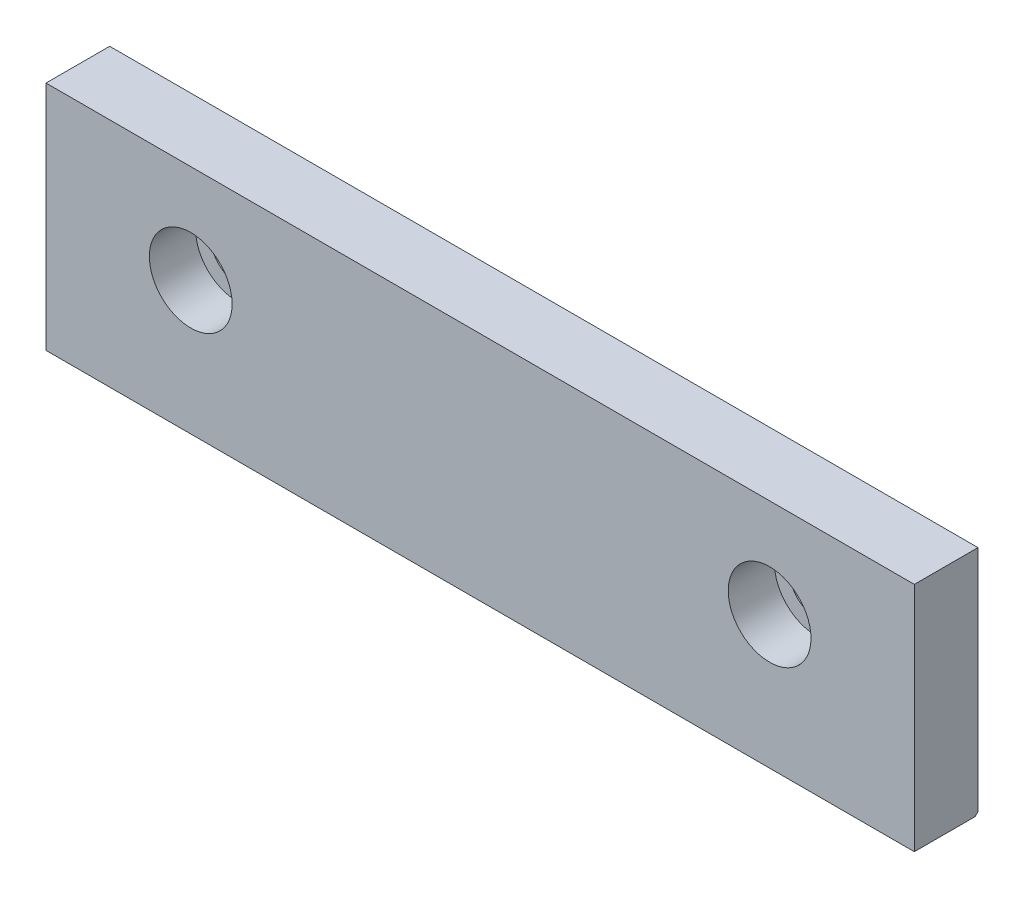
ISO-10303-21;
HEADER;
FILE_DESCRIPTION(('STEP AP214'),'2;1');
FILE_NAME('part.step','',(''),(''),'','','');
FILE_SCHEMA(('AUTOMOTIVE_DESIGN { 1 0 10303 214 1 1 1 1 }'));
ENDSEC;
DATA;
#1=APPLICATION_CONTEXT('core data for automotive mechanical design processes');
#2=APPLICATION_PROTOCOL_DEFINITION('international standard','automotive_design',2000,#1);
#3=PRODUCT_CONTEXT('',#1,'mechanical');
#4=PRODUCT('Part','Part','',(#3));
#5=PRODUCT_RELATED_PRODUCT_CATEGORY('part','',(#4));
#6=PRODUCT_DEFINITION_FORMATION('','',#4);
#7=PRODUCT_DEFINITION_CONTEXT('part definition',#1,'design');
#8=PRODUCT_DEFINITION('design','',#6,#7);
#9=PRODUCT_DEFINITION_SHAPE('','',#8);
#10=(LENGTH_UNIT() NAMED_UNIT(*) SI_UNIT(.MILLI.,.METRE.));
#11=(NAMED_UNIT(*) PLANE_ANGLE_UNIT() SI_UNIT($,.RADIAN.));
#12=(NAMED_UNIT(*) SI_UNIT($,.STERADIAN.) SOLID_ANGLE_UNIT());
#13=UNCERTAINTY_MEASURE_WITH_UNIT(LENGTH_MEASURE(1.E-05),#10,'distance_accuracy_value','');
#14=(GEOMETRIC_REPRESENTATION_CONTEXT(3) GLOBAL_UNCERTAINTY_ASSIGNED_CONTEXT((#13)) GLOBAL_UNIT_ASSIGNED_CONTEXT((#10,
#11,#12)) REPRESENTATION_CONTEXT('',''));
#15=CARTESIAN_POINT('',(0.,0.,0.));
#16=DIRECTION('',(0.,0.,1.));
#17=DIRECTION('',(1.,0.,0.));
#18=AXIS2_PLACEMENT_3D('',#15,#16,#17);
#19=CARTESIAN_POINT('',(-75.,20.,11.));
#20=DIRECTION('',(1.,0.,0.));
#21=DIRECTION('',(0.,1.,0.));
#22=AXIS2_PLACEMENT_3D('',#19,#20,#21);
#23=PLANE('',#22);
#24=DIRECTION('',(0.,-1.,0.));
#25=VECTOR('',#24,1.);
#26=CARTESIAN_POINT('',(-75.,20.,0.));
#27=LINE('',#26,#25);
#28=CARTESIAN_POINT('',(-75.,20.,0.));
#29=VERTEX_POINT('',#28);
#30=CARTESIAN_POINT('',(-75.,-19.5,0.));
#31=VERTEX_POINT('',#30);
#32=EDGE_CURVE('E402',#29,#31,#27,.T.);
#33=ORIENTED_EDGE('',*,*,#32,.T.);
#34=DIRECTION('',(0.,0.707106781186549,-0.707106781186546));
#35=VECTOR('',#34,1.);
#36=CARTESIAN_POINT('',(-75.,-20.,0.5));
#37=LINE('',#36,#35);
#38=CARTESIAN_POINT('',(-75.,-20.,0.5));
#39=VERTEX_POINT('',#38);
#40=EDGE_CURVE('E11',#31,#39,#37,.F.);
#41=ORIENTED_EDGE('',*,*,#40,.T.);
#42=DIRECTION('',(0.,0.,-1.));
#43=VECTOR('',#42,1.);
#44=CARTESIAN_POINT('',(-75.,-20.,11.));
#45=LINE('',#44,#43);
#46=CARTESIAN_POINT('',(-75.,-20.,11.));
#47=VERTEX_POINT('',#46);
#48=EDGE_CURVE('E426',#47,#39,#45,.T.);
#49=ORIENTED_EDGE('',*,*,#48,.F.);
#50=DIRECTION('',(0.,-1.,0.));
#51=VECTOR('',#50,1.);
#52=CARTESIAN_POINT('',(-75.,20.,11.));
#53=LINE('',#52,#51);
#54=CARTESIAN_POINT('',(-75.,20.,11.));
#55=VERTEX_POINT('',#54);
#56=EDGE_CURVE('E413',#55,#47,#53,.T.);
#57=ORIENTED_EDGE('',*,*,#56,.F.);
#58=DIRECTION('',(0.,0.,-1.));
#59=VECTOR('',#58,1.);
#60=CARTESIAN_POINT('',(-75.,20.,11.));
#61=LINE('',#60,#59);
#62=EDGE_CURVE('E410',#55,#29,#61,.T.);
#63=ORIENTED_EDGE('',*,*,#62,.T.);
#64=EDGE_LOOP('',(#33,#41,#49,#57,#63));
#65=FACE_BOUND('',#64,.T.);
#66=ADVANCED_FACE('F351',(#65),#23,.F.);
#67=CARTESIAN_POINT('',(-75.,-20.,11.));
#68=DIRECTION('',(0.,1.,0.));
#69=DIRECTION('',(-1.,0.,0.));
#70=AXIS2_PLACEMENT_3D('',#67,#68,#69);
#71=PLANE('',#70);
#72=ORIENTED_EDGE('',*,*,#48,.T.);
#73=DIRECTION('',(1.,0.,0.));
#74=VECTOR('',#73,1.);
#75=CARTESIAN_POINT('',(-75.,-20.,0.5));
#76=LINE('',#75,#74);
#77=CARTESIAN_POINT('',(75.,-20.,0.5));
#78=VERTEX_POINT('',#77);
#79=EDGE_CURVE('E429',#39,#78,#76,.T.);
#80=ORIENTED_EDGE('',*,*,#79,.T.);
#81=DIRECTION('',(0.,0.,-1.));
#82=VECTOR('',#81,1.);
#83=CARTESIAN_POINT('',(75.,-20.,11.));
#84=LINE('',#83,#82);
#85=CARTESIAN_POINT('',(75.,-20.,11.));
#86=VERTEX_POINT('',#85);
#87=EDGE_CURVE('E409',#86,#78,#84,.T.);
#88=ORIENTED_EDGE('',*,*,#87,.F.);
#89=DIRECTION('',(1.,0.,0.));
#90=VECTOR('',#89,1.);
#91=CARTESIAN_POINT('',(-75.,-20.,11.));
#92=LINE('',#91,#90);
#93=EDGE_CURVE('E416',#47,#86,#92,.T.);
#94=ORIENTED_EDGE('',*,*,#93,.F.);
#95=EDGE_LOOP('',(#72,#80,#88,#94));
#96=FACE_BOUND('',#95,.T.);
#97=ADVANCED_FACE('F435',(#96),#71,.F.);
#98=CARTESIAN_POINT('',(75.,20.,11.));
#99=DIRECTION('',(-1.,0.,0.));
#100=DIRECTION('',(0.,0.,1.));
#101=AXIS2_PLACEMENT_3D('',#98,#99,#100);
#102=PLANE('',#101);
#103=ORIENTED_EDGE('',*,*,#87,.T.);
#104=DIRECTION('',(0.,-0.707106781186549,0.707106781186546));
#105=VECTOR('',#104,1.);
#106=CARTESIAN_POINT('',(75.,-20.,0.5));
#107=LINE('',#106,#105);
#108=CARTESIAN_POINT('',(75.,-19.5,0.));
#109=VERTEX_POINT('',#108);
#110=EDGE_CURVE('E372',#78,#109,#107,.F.);
#111=ORIENTED_EDGE('',*,*,#110,.T.);
#112=DIRECTION('',(0.,1.,0.));
#113=VECTOR('',#112,1.);
#114=CARTESIAN_POINT('',(75.,20.,0.));
#115=LINE('',#114,#113);
#116=CARTESIAN_POINT('',(75.,20.,0.));
#117=VERTEX_POINT('',#116);
#118=EDGE_CURVE('E394',#109,#117,#115,.T.);
#119=ORIENTED_EDGE('',*,*,#118,.T.);
#120=DIRECTION('',(0.,0.,-1.));
#121=VECTOR('',#120,1.);
#122=CARTESIAN_POINT('',(75.,20.,11.));
#123=LINE('',#122,#121);
#124=CARTESIAN_POINT('',(75.,20.,11.));
#125=VERTEX_POINT('',#124);
#126=EDGE_CURVE('E398',#125,#117,#123,.T.);
#127=ORIENTED_EDGE('',*,*,#126,.F.);
#128=DIRECTION('',(0.,1.,0.));
#129=VECTOR('',#128,1.);
#130=CARTESIAN_POINT('',(75.,20.,11.));
#131=LINE('',#130,#129);
#132=EDGE_CURVE('E421',#86,#125,#131,.T.);
#133=ORIENTED_EDGE('',*,*,#132,.F.);
#134=EDGE_LOOP('',(#103,#111,#119,#127,#133));
#135=FACE_BOUND('',#134,.T.);
#136=ADVANCED_FACE('F396',(#135),#102,.F.);
#137=CARTESIAN_POINT('',(-75.,20.,11.));
#138=DIRECTION('',(0.,-1.,0.));
#139=DIRECTION('',(0.,0.,-1.));
#140=AXIS2_PLACEMENT_3D('',#137,#138,#139);
#141=PLANE('',#140);
#142=DIRECTION('',(-1.,0.,0.));
#143=VECTOR('',#142,1.);
#144=CARTESIAN_POINT('',(-75.,20.,0.));
#145=LINE('',#144,#143);
#146=EDGE_CURVE('E401',#117,#29,#145,.T.);
#147=ORIENTED_EDGE('',*,*,#146,.T.);
#148=ORIENTED_EDGE('',*,*,#62,.F.);
#149=DIRECTION('',(-1.,0.,0.));
#150=VECTOR('',#149,1.);
#151=CARTESIAN_POINT('',(-75.,20.,11.));
#152=LINE('',#151,#150);
#153=EDGE_CURVE('E408',#125,#55,#152,.T.);
#154=ORIENTED_EDGE('',*,*,#153,.F.);
#155=ORIENTED_EDGE('',*,*,#126,.T.);
#156=EDGE_LOOP('',(#147,#148,#154,#155));
#157=FACE_BOUND('',#156,.T.);
#158=ADVANCED_FACE('F405',(#157),#141,.F.);
#159=CARTESIAN_POINT('',(-75.,-20.,11.));
#160=DIRECTION('',(0.,0.,1.));
#161=DIRECTION('',(1.,0.,0.));
#162=AXIS2_PLACEMENT_3D('',#159,#160,#161);
#163=PLANE('',#162);
#164=CARTESIAN_POINT('',(-50.,3.,11.));
#165=DIRECTION('',(0.,0.,1.));
#166=DIRECTION('',(1.,0.,0.));
#167=AXIS2_PLACEMENT_3D('',#164,#165,#166);
#168=CIRCLE('',#167,7.14999999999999);
#169=CARTESIAN_POINT('',(-42.85,3.,11.));
#170=VERTEX_POINT('',#169);
#171=EDGE_CURVE('E497',#170,#170,#168,.T.);
#172=ORIENTED_EDGE('',*,*,#171,.F.);
#173=EDGE_LOOP('',(#172));
#174=FACE_BOUND('',#173,.T.);
#175=CARTESIAN_POINT('',(50.,3.,11.));
#176=DIRECTION('',(0.,0.,1.));
#177=DIRECTION('',(1.,0.,0.));
#178=AXIS2_PLACEMENT_3D('',#175,#176,#177);
#179=CIRCLE('',#178,7.14999999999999);
#180=CARTESIAN_POINT('',(57.15,3.,11.));
#181=VERTEX_POINT('',#180);
#182=EDGE_CURVE('E512',#181,#181,#179,.T.);
#183=ORIENTED_EDGE('',*,*,#182,.F.);
#184=EDGE_LOOP('',(#183));
#185=FACE_BOUND('',#184,.T.);
#186=ORIENTED_EDGE('',*,*,#56,.T.);
#187=ORIENTED_EDGE('',*,*,#93,.T.);
#188=ORIENTED_EDGE('',*,*,#132,.T.);
#189=ORIENTED_EDGE('',*,*,#153,.T.);
#190=EDGE_LOOP('',(#186,#187,#188,#189));
#191=FACE_BOUND('',#190,.T.);
#192=ADVANCED_FACE('F440',(#174,#185,#191),#163,.T.);
#193=CARTESIAN_POINT('',(-75.,-20.,0.));
#194=DIRECTION('',(0.,0.,1.));
#195=DIRECTION('',(1.,0.,0.));
#196=AXIS2_PLACEMENT_3D('',#193,#194,#195);
#197=PLANE('',#196);
#198=CARTESIAN_POINT('',(-50.,3.,0.));
#199=DIRECTION('',(0.,0.,1.));
#200=DIRECTION('',(1.,0.,0.));
#201=AXIS2_PLACEMENT_3D('',#198,#199,#200);
#202=CIRCLE('',#201,4.5);
#203=CARTESIAN_POINT('',(-45.5,3.,0.));
#204=VERTEX_POINT('',#203);
#205=EDGE_CURVE('E500',#204,#204,#202,.T.);
#206=ORIENTED_EDGE('',*,*,#205,.T.);
#207=EDGE_LOOP('',(#206));
#208=FACE_BOUND('',#207,.T.);
#209=CARTESIAN_POINT('',(50.,3.,0.));
#210=DIRECTION('',(0.,0.,1.));
#211=DIRECTION('',(1.,0.,0.));
#212=AXIS2_PLACEMENT_3D('',#209,#210,#211);
#213=CIRCLE('',#212,4.5);
#214=CARTESIAN_POINT('',(54.5,3.,0.));
#215=VERTEX_POINT('',#214);
#216=EDGE_CURVE('E515',#215,#215,#213,.T.);
#217=ORIENTED_EDGE('',*,*,#216,.T.);
#218=EDGE_LOOP('',(#217));
#219=FACE_BOUND('',#218,.T.);
#220=ORIENTED_EDGE('',*,*,#118,.F.);
#221=DIRECTION('',(-1.,0.,0.));
#222=VECTOR('',#221,1.);
#223=CARTESIAN_POINT('',(-75.,-19.5,0.));
#224=LINE('',#223,#222);
#225=EDGE_CURVE('E358',#109,#31,#224,.T.);
#226=ORIENTED_EDGE('',*,*,#225,.T.);
#227=ORIENTED_EDGE('',*,*,#32,.F.);
#228=ORIENTED_EDGE('',*,*,#146,.F.);
#229=EDGE_LOOP('',(#220,#226,#227,#228));
#230=FACE_BOUND('',#229,.T.);
#231=ADVANCED_FACE('F412',(#208,#219,#230),#197,.F.);
#232=CARTESIAN_POINT('',(50.,3.,11.));
#233=DIRECTION('',(0.,0.,1.));
#234=DIRECTION('',(1.,0.,0.));
#235=AXIS2_PLACEMENT_3D('',#232,#233,#234);
#236=CYLINDRICAL_SURFACE('',#235,7.14999999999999);
#237=CARTESIAN_POINT('',(50.,3.,3.));
#238=DIRECTION('',(0.,0.,1.));
#239=DIRECTION('',(1.,0.,0.));
#240=AXIS2_PLACEMENT_3D('',#237,#238,#239);
#241=CIRCLE('',#240,7.15);
#242=CARTESIAN_POINT('',(57.15,3.,3.));
#243=VERTEX_POINT('',#242);
#244=EDGE_CURVE('E509',#243,#243,#241,.T.);
#245=ORIENTED_EDGE('',*,*,#244,.F.);
#246=EDGE_LOOP('',(#245));
#247=FACE_BOUND('',#246,.T.);
#248=ORIENTED_EDGE('',*,*,#182,.T.);
#249=EDGE_LOOP('',(#248));
#250=FACE_BOUND('',#249,.T.);
#251=ADVANCED_FACE('F469',(#247,#250),#236,.F.);
#252=CARTESIAN_POINT('',(54.5,3.,3.));
#253=DIRECTION('',(0.,0.,-1.));
#254=DIRECTION('',(-1.,0.,0.));
#255=AXIS2_PLACEMENT_3D('',#252,#253,#254);
#256=PLANE('',#255);
#257=CARTESIAN_POINT('',(50.,3.,3.));
#258=DIRECTION('',(0.,0.,1.));
#259=DIRECTION('',(1.,0.,0.));
#260=AXIS2_PLACEMENT_3D('',#257,#258,#259);
#261=CIRCLE('',#260,4.5);
#262=CARTESIAN_POINT('',(54.5,3.,3.));
#263=VERTEX_POINT('',#262);
#264=EDGE_CURVE('E506',#263,#263,#261,.T.);
#265=ORIENTED_EDGE('',*,*,#264,.F.);
#266=EDGE_LOOP('',(#265));
#267=FACE_BOUND('',#266,.T.);
#268=ORIENTED_EDGE('',*,*,#244,.T.);
#269=EDGE_LOOP('',(#268));
#270=FACE_BOUND('',#269,.T.);
#271=ADVANCED_FACE('F473',(#267,#270),#256,.F.);
#272=CARTESIAN_POINT('',(50.,3.,11.));
#273=DIRECTION('',(0.,0.,1.));
#274=DIRECTION('',(1.,0.,0.));
#275=AXIS2_PLACEMENT_3D('',#272,#273,#274);
#276=CYLINDRICAL_SURFACE('',#275,4.5);
#277=ORIENTED_EDGE('',*,*,#216,.F.);
#278=EDGE_LOOP('',(#277));
#279=FACE_BOUND('',#278,.T.);
#280=ORIENTED_EDGE('',*,*,#264,.T.);
#281=EDGE_LOOP('',(#280));
#282=FACE_BOUND('',#281,.T.);
#283=ADVANCED_FACE('F477',(#279,#282),#276,.F.);
#284=CARTESIAN_POINT('',(-50.,3.,11.));
#285=DIRECTION('',(0.,0.,1.));
#286=DIRECTION('',(1.,0.,0.));
#287=AXIS2_PLACEMENT_3D('',#284,#285,#286);
#288=CYLINDRICAL_SURFACE('',#287,7.14999999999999);
#289=CARTESIAN_POINT('',(-50.,3.,3.));
#290=DIRECTION('',(0.,0.,1.));
#291=DIRECTION('',(1.,0.,0.));
#292=AXIS2_PLACEMENT_3D('',#289,#290,#291);
#293=CIRCLE('',#292,7.15);
#294=CARTESIAN_POINT('',(-42.85,3.,3.));
#295=VERTEX_POINT('',#294);
#296=EDGE_CURVE('E496',#295,#295,#293,.T.);
#297=ORIENTED_EDGE('',*,*,#296,.F.);
#298=EDGE_LOOP('',(#297));
#299=FACE_BOUND('',#298,.T.);
#300=ORIENTED_EDGE('',*,*,#171,.T.);
#301=EDGE_LOOP('',(#300));
#302=FACE_BOUND('',#301,.T.);
#303=ADVANCED_FACE('F481',(#299,#302),#288,.F.);
#304=CARTESIAN_POINT('',(-45.5,3.,3.));
#305=DIRECTION('',(0.,0.,-1.));
#306=DIRECTION('',(-1.,0.,0.));
#307=AXIS2_PLACEMENT_3D('',#304,#305,#306);
#308=PLANE('',#307);
#309=CARTESIAN_POINT('',(-50.,3.,3.));
#310=DIRECTION('',(0.,0.,1.));
#311=DIRECTION('',(1.,0.,0.));
#312=AXIS2_PLACEMENT_3D('',#309,#310,#311);
#313=CIRCLE('',#312,4.5);
#314=CARTESIAN_POINT('',(-45.5,3.,3.));
#315=VERTEX_POINT('',#314);
#316=EDGE_CURVE('E493',#315,#315,#313,.T.);
#317=ORIENTED_EDGE('',*,*,#316,.F.);
#318=EDGE_LOOP('',(#317));
#319=FACE_BOUND('',#318,.T.);
#320=ORIENTED_EDGE('',*,*,#296,.T.);
#321=EDGE_LOOP('',(#320));
#322=FACE_BOUND('',#321,.T.);
#323=ADVANCED_FACE('F450',(#319,#322),#308,.F.);
#324=CARTESIAN_POINT('',(-50.,3.,11.));
#325=DIRECTION('',(0.,0.,1.));
#326=DIRECTION('',(1.,0.,0.));
#327=AXIS2_PLACEMENT_3D('',#324,#325,#326);
#328=CYLINDRICAL_SURFACE('',#327,4.5);
#329=ORIENTED_EDGE('',*,*,#205,.F.);
#330=EDGE_LOOP('',(#329));
#331=FACE_BOUND('',#330,.T.);
#332=ORIENTED_EDGE('',*,*,#316,.T.);
#333=EDGE_LOOP('',(#332));
#334=FACE_BOUND('',#333,.T.);
#335=ADVANCED_FACE('F445',(#331,#334),#328,.F.);
#336=CARTESIAN_POINT('',(-75.,-20.,0.5));
#337=DIRECTION('',(0.,0.707106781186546,0.707106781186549));
#338=DIRECTION('',(0.,-0.707106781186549,0.707106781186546));
#339=AXIS2_PLACEMENT_3D('',#336,#337,#338);
#340=PLANE('',#339);
#341=ORIENTED_EDGE('',*,*,#40,.F.);
#342=ORIENTED_EDGE('',*,*,#225,.F.);
#343=ORIENTED_EDGE('',*,*,#110,.F.);
#344=ORIENTED_EDGE('',*,*,#79,.F.);
#345=EDGE_LOOP('',(#341,#342,#343,#344));
#346=FACE_BOUND('',#345,.T.);
#347=ADVANCED_FACE('F443',(#346),#340,.F.);
#348=CLOSED_SHELL('',(#66,#97,#136,#158,#192,#231,#251,#271,#283,#303,#323,#335,#347));
#349=MANIFOLD_SOLID_BREP('B2',#348);
#350=ADVANCED_BREP_SHAPE_REPRESENTATION('',(#18,#349),#14);
#351=SHAPE_DEFINITION_REPRESENTATION(#9,#350);
ENDSEC;
END-ISO-10303-21;
